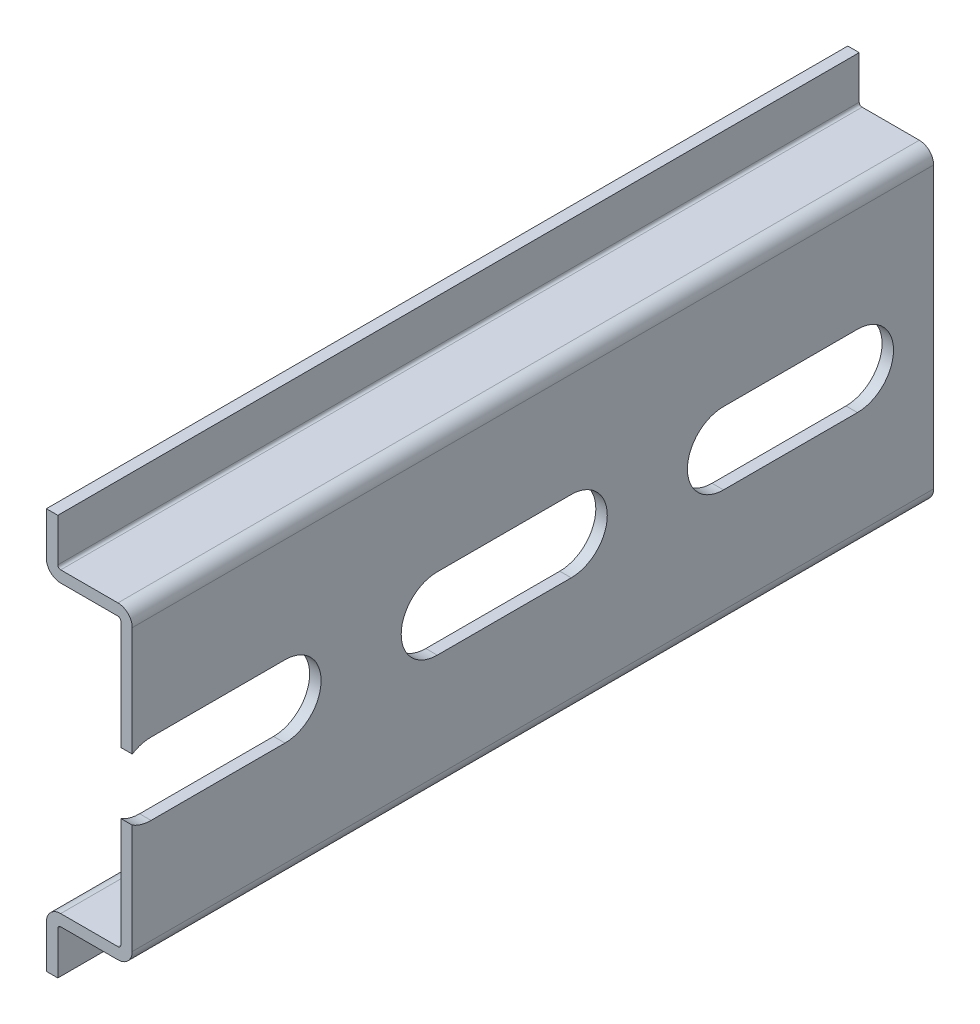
ISO-10303-21;
HEADER;
FILE_DESCRIPTION(('STEP AP214'),'2;1');
FILE_NAME('part.step','',(''),(''),'','','');
FILE_SCHEMA(('AUTOMOTIVE_DESIGN { 1 0 10303 214 1 1 1 1 }'));
ENDSEC;
DATA;
#1=APPLICATION_CONTEXT('core data for automotive mechanical design processes');
#2=APPLICATION_PROTOCOL_DEFINITION('international standard','automotive_design',2000,#1);
#3=PRODUCT_CONTEXT('',#1,'mechanical');
#4=PRODUCT('Part','Part','',(#3));
#5=PRODUCT_RELATED_PRODUCT_CATEGORY('part','',(#4));
#6=PRODUCT_DEFINITION_FORMATION('','',#4);
#7=PRODUCT_DEFINITION_CONTEXT('part definition',#1,'design');
#8=PRODUCT_DEFINITION('design','',#6,#7);
#9=PRODUCT_DEFINITION_SHAPE('','',#8);
#10=(LENGTH_UNIT() NAMED_UNIT(*) SI_UNIT(.MILLI.,.METRE.));
#11=(NAMED_UNIT(*) PLANE_ANGLE_UNIT() SI_UNIT($,.RADIAN.));
#12=(NAMED_UNIT(*) SI_UNIT($,.STERADIAN.) SOLID_ANGLE_UNIT());
#13=UNCERTAINTY_MEASURE_WITH_UNIT(LENGTH_MEASURE(1.E-05),#10,'distance_accuracy_value','');
#14=(GEOMETRIC_REPRESENTATION_CONTEXT(3) GLOBAL_UNCERTAINTY_ASSIGNED_CONTEXT((#13)) GLOBAL_UNIT_ASSIGNED_CONTEXT((#10,
#11,#12)) REPRESENTATION_CONTEXT('',''));
#15=CARTESIAN_POINT('',(0.,0.,0.));
#16=DIRECTION('',(0.,0.,1.));
#17=DIRECTION('',(1.,0.,0.));
#18=AXIS2_PLACEMENT_3D('',#15,#16,#17);
#19=CARTESIAN_POINT('',(-7.5,0.,18.3499999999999));
#20=DIRECTION('',(1.,0.,0.));
#21=DIRECTION('',(0.,0.,-1.));
#22=AXIS2_PLACEMENT_3D('',#19,#20,#21);
#23=CYLINDRICAL_SURFACE('',#22,3.15);
#24=CARTESIAN_POINT('',(0.,0.,18.3499999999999));
#25=DIRECTION('',(1.,0.,0.));
#26=DIRECTION('',(0.,0.,-1.));
#27=AXIS2_PLACEMENT_3D('',#24,#25,#26);
#28=CIRCLE('',#27,3.15);
#29=CARTESIAN_POINT('',(0.,2.68711479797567,19.99375));
#30=VERTEX_POINT('',#29);
#31=CARTESIAN_POINT('',(0.,3.14999999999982,18.3499999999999));
#32=VERTEX_POINT('',#31);
#33=EDGE_CURVE('E341',#30,#32,#28,.F.);
#34=ORIENTED_EDGE('',*,*,#33,.F.);
#35=DIRECTION('',(1.,0.,0.));
#36=VECTOR('',#35,1.);
#37=CARTESIAN_POINT('',(-7.5,2.68711479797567,19.99375));
#38=LINE('',#37,#36);
#39=CARTESIAN_POINT('',(-1.,2.68711479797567,19.99375));
#40=VERTEX_POINT('',#39);
#41=EDGE_CURVE('E452',#30,#40,#38,.F.);
#42=ORIENTED_EDGE('',*,*,#41,.T.);
#43=CARTESIAN_POINT('',(-1.,0.,18.3499999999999));
#44=DIRECTION('',(-1.,0.,0.));
#45=DIRECTION('',(0.,-1.,0.));
#46=AXIS2_PLACEMENT_3D('',#43,#44,#45);
#47=CIRCLE('',#46,3.15);
#48=CARTESIAN_POINT('',(-1.00000000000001,3.14999999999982,18.3499999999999));
#49=VERTEX_POINT('',#48);
#50=EDGE_CURVE('E569',#40,#49,#47,.T.);
#51=ORIENTED_EDGE('',*,*,#50,.T.);
#52=DIRECTION('',(1.,0.,0.));
#53=VECTOR('',#52,1.);
#54=CARTESIAN_POINT('',(-7.5,3.14999999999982,18.3499999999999));
#55=LINE('',#54,#53);
#56=EDGE_CURVE('E502',#49,#32,#55,.T.);
#57=ORIENTED_EDGE('',*,*,#56,.T.);
#58=EDGE_LOOP('',(#34,#42,#51,#57));
#59=FACE_BOUND('',#58,.T.);
#60=ADVANCED_FACE('F41',(#59),#23,.F.);
#61=CARTESIAN_POINT('',(-6.5,13.5,50.00625));
#62=DIRECTION('',(-1.,0.,0.));
#63=DIRECTION('',(0.,-1.,0.));
#64=AXIS2_PLACEMENT_3D('',#61,#62,#63);
#65=PLANE('',#64);
#66=DIRECTION('',(0.,0.,-1.));
#67=VECTOR('',#66,1.);
#68=CARTESIAN_POINT('',(-6.5,17.5,50.00625));
#69=LINE('',#68,#67);
#70=CARTESIAN_POINT('',(-6.5,17.5,19.99375));
#71=VERTEX_POINT('',#70);
#72=CARTESIAN_POINT('',(-6.5,17.5,-50.00625));
#73=VERTEX_POINT('',#72);
#74=EDGE_CURVE('E289',#71,#73,#69,.T.);
#75=ORIENTED_EDGE('',*,*,#74,.F.);
#76=DIRECTION('',(0.,-1.,0.));
#77=VECTOR('',#76,1.);
#78=CARTESIAN_POINT('',(-6.5,13.5,19.99375));
#79=LINE('',#78,#77);
#80=CARTESIAN_POINT('',(-6.5,13.75,19.99375));
#81=VERTEX_POINT('',#80);
#82=EDGE_CURVE('E468',#71,#81,#79,.T.);
#83=ORIENTED_EDGE('',*,*,#82,.T.);
#84=DIRECTION('',(0.,0.,-1.));
#85=VECTOR('',#84,1.);
#86=CARTESIAN_POINT('',(-6.5,13.75,-50.00625));
#87=LINE('',#86,#85);
#88=CARTESIAN_POINT('',(-6.5,13.75,-50.00625));
#89=VERTEX_POINT('',#88);
#90=EDGE_CURVE('E346',#81,#89,#87,.T.);
#91=ORIENTED_EDGE('',*,*,#90,.T.);
#92=DIRECTION('',(0.,1.,0.));
#93=VECTOR('',#92,1.);
#94=CARTESIAN_POINT('',(-6.5,13.5,-50.00625));
#95=LINE('',#94,#93);
#96=EDGE_CURVE('E574',#89,#73,#95,.T.);
#97=ORIENTED_EDGE('',*,*,#96,.T.);
#98=EDGE_LOOP('',(#75,#83,#91,#97));
#99=FACE_BOUND('',#98,.T.);
#100=ADVANCED_FACE('F628',(#99),#65,.F.);
#101=CARTESIAN_POINT('',(-7.5,17.5,50.00625));
#102=DIRECTION('',(0.,1.,0.));
#103=DIRECTION('',(0.,0.,1.));
#104=AXIS2_PLACEMENT_3D('',#101,#102,#103);
#105=PLANE('',#104);
#106=DIRECTION('',(1.,0.,0.));
#107=VECTOR('',#106,1.);
#108=CARTESIAN_POINT('',(-7.5,17.5,19.99375));
#109=LINE('',#108,#107);
#110=CARTESIAN_POINT('',(-7.5,17.5,19.99375));
#111=VERTEX_POINT('',#110);
#112=EDGE_CURVE('E277',#111,#71,#109,.T.);
#113=ORIENTED_EDGE('',*,*,#112,.T.);
#114=ORIENTED_EDGE('',*,*,#74,.T.);
#115=DIRECTION('',(1.,0.,0.));
#116=VECTOR('',#115,1.);
#117=CARTESIAN_POINT('',(-7.5,17.5,-50.00625));
#118=LINE('',#117,#116);
#119=CARTESIAN_POINT('',(-7.5,17.5,-50.00625));
#120=VERTEX_POINT('',#119);
#121=EDGE_CURVE('E578',#120,#73,#118,.T.);
#122=ORIENTED_EDGE('',*,*,#121,.F.);
#123=DIRECTION('',(0.,0.,-1.));
#124=VECTOR('',#123,1.);
#125=CARTESIAN_POINT('',(-7.5,17.5,50.00625));
#126=LINE('',#125,#124);
#127=EDGE_CURVE('E284',#111,#120,#126,.T.);
#128=ORIENTED_EDGE('',*,*,#127,.F.);
#129=EDGE_LOOP('',(#113,#114,#122,#128));
#130=FACE_BOUND('',#129,.T.);
#131=ADVANCED_FACE('F631',(#130),#105,.T.);
#132=CARTESIAN_POINT('',(-7.5,13.5,50.00625));
#133=DIRECTION('',(-1.,0.,0.));
#134=DIRECTION('',(0.,-1.,0.));
#135=AXIS2_PLACEMENT_3D('',#132,#133,#134);
#136=PLANE('',#135);
#137=DIRECTION('',(0.,1.,0.));
#138=VECTOR('',#137,1.);
#139=CARTESIAN_POINT('',(-7.5,17.5,19.99375));
#140=LINE('',#139,#138);
#141=CARTESIAN_POINT('',(-7.5,13.75,19.99375));
#142=VERTEX_POINT('',#141);
#143=EDGE_CURVE('E63',#142,#111,#140,.T.);
#144=ORIENTED_EDGE('',*,*,#143,.T.);
#145=ORIENTED_EDGE('',*,*,#127,.T.);
#146=DIRECTION('',(0.,1.,0.));
#147=VECTOR('',#146,1.);
#148=CARTESIAN_POINT('',(-7.5,13.5,-50.00625));
#149=LINE('',#148,#147);
#150=CARTESIAN_POINT('',(-7.5,13.75,-50.00625));
#151=VERTEX_POINT('',#150);
#152=EDGE_CURVE('E431',#151,#120,#149,.T.);
#153=ORIENTED_EDGE('',*,*,#152,.F.);
#154=DIRECTION('',(0.,0.,-1.));
#155=VECTOR('',#154,1.);
#156=CARTESIAN_POINT('',(-7.5,13.75,50.00625));
#157=LINE('',#156,#155);
#158=EDGE_CURVE('E49',#151,#142,#157,.F.);
#159=ORIENTED_EDGE('',*,*,#158,.T.);
#160=EDGE_LOOP('',(#144,#145,#153,#159));
#161=FACE_BOUND('',#160,.T.);
#162=ADVANCED_FACE('F428',(#161),#136,.T.);
#163=CARTESIAN_POINT('',(0.,12.5,50.00625));
#164=DIRECTION('',(0.,-1.,0.));
#165=DIRECTION('',(1.,0.,0.));
#166=AXIS2_PLACEMENT_3D('',#163,#164,#165);
#167=PLANE('',#166);
#168=DIRECTION('',(1.,0.,0.));
#169=VECTOR('',#168,1.);
#170=CARTESIAN_POINT('',(0.,12.5,19.99375));
#171=LINE('',#170,#169);
#172=CARTESIAN_POINT('',(-6.25,12.5,19.99375));
#173=VERTEX_POINT('',#172);
#174=CARTESIAN_POINT('',(-1.25,12.5,19.99375));
#175=VERTEX_POINT('',#174);
#176=EDGE_CURVE('E438',#173,#175,#171,.T.);
#177=ORIENTED_EDGE('',*,*,#176,.F.);
#178=DIRECTION('',(0.,0.,-1.));
#179=VECTOR('',#178,1.);
#180=CARTESIAN_POINT('',(-6.25,12.5,50.00625));
#181=LINE('',#180,#179);
#182=CARTESIAN_POINT('',(-6.25,12.5,-50.00625));
#183=VERTEX_POINT('',#182);
#184=EDGE_CURVE('E420',#173,#183,#181,.T.);
#185=ORIENTED_EDGE('',*,*,#184,.T.);
#186=DIRECTION('',(-1.,0.,0.));
#187=VECTOR('',#186,1.);
#188=CARTESIAN_POINT('',(0.,12.5,-50.00625));
#189=LINE('',#188,#187);
#190=CARTESIAN_POINT('',(-1.25,12.5,-50.00625));
#191=VERTEX_POINT('',#190);
#192=EDGE_CURVE('E584',#191,#183,#189,.T.);
#193=ORIENTED_EDGE('',*,*,#192,.F.);
#194=DIRECTION('',(0.,0.,-1.));
#195=VECTOR('',#194,1.);
#196=CARTESIAN_POINT('',(-1.25,12.5,50.00625));
#197=LINE('',#196,#195);
#198=EDGE_CURVE('E367',#191,#175,#197,.F.);
#199=ORIENTED_EDGE('',*,*,#198,.T.);
#200=EDGE_LOOP('',(#177,#185,#193,#199));
#201=FACE_BOUND('',#200,.T.);
#202=ADVANCED_FACE('F441',(#201),#167,.T.);
#203=CARTESIAN_POINT('',(-1.,-13.5,50.00625));
#204=DIRECTION('',(-1.,0.,0.));
#205=DIRECTION('',(0.,-1.,0.));
#206=AXIS2_PLACEMENT_3D('',#203,#204,#205);
#207=PLANE('',#206);
#208=DIRECTION('',(0.,-1.,0.));
#209=VECTOR('',#208,1.);
#210=CARTESIAN_POINT('',(-1.,-13.5,19.99375));
#211=LINE('',#210,#209);
#212=CARTESIAN_POINT('',(-1.,12.25,19.99375));
#213=VERTEX_POINT('',#212);
#214=EDGE_CURVE('E446',#213,#40,#211,.T.);
#215=ORIENTED_EDGE('',*,*,#214,.F.);
#216=DIRECTION('',(0.,0.,-1.));
#217=VECTOR('',#216,1.);
#218=CARTESIAN_POINT('',(-1.,12.25,-50.00625));
#219=LINE('',#218,#217);
#220=CARTESIAN_POINT('',(-1.,12.25,-50.00625));
#221=VERTEX_POINT('',#220);
#222=EDGE_CURVE('E364',#213,#221,#219,.T.);
#223=ORIENTED_EDGE('',*,*,#222,.T.);
#224=DIRECTION('',(0.,1.,0.));
#225=VECTOR('',#224,1.);
#226=CARTESIAN_POINT('',(-1.,-13.5,-50.00625));
#227=LINE('',#226,#225);
#228=CARTESIAN_POINT('',(-1.,-12.25,-50.00625));
#229=VERTEX_POINT('',#228);
#230=EDGE_CURVE('E587',#229,#221,#227,.T.);
#231=ORIENTED_EDGE('',*,*,#230,.F.);
#232=DIRECTION('',(0.,0.,-1.));
#233=VECTOR('',#232,1.);
#234=CARTESIAN_POINT('',(-1.,-12.25,50.00625));
#235=LINE('',#234,#233);
#236=CARTESIAN_POINT('',(-1.,-12.25,19.99375));
#237=VERTEX_POINT('',#236);
#238=EDGE_CURVE('E360',#229,#237,#235,.F.);
#239=ORIENTED_EDGE('',*,*,#238,.T.);
#240=CARTESIAN_POINT('',(-1.00000000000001,-2.68711479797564,19.99375));
#241=VERTEX_POINT('',#240);
#242=EDGE_CURVE('E453',#241,#237,#211,.T.);
#243=ORIENTED_EDGE('',*,*,#242,.F.);
#244=CARTESIAN_POINT('',(-1.,-3.15000000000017,18.3499999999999));
#245=VERTEX_POINT('',#244);
#246=EDGE_CURVE('E570',#245,#241,#47,.T.);
#247=ORIENTED_EDGE('',*,*,#246,.F.);
#248=DIRECTION('',(0.,0.,1.));
#249=VECTOR('',#248,1.);
#250=CARTESIAN_POINT('',(-1.,-3.15000000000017,50.00625));
#251=LINE('',#250,#249);
#252=CARTESIAN_POINT('',(-1.,-3.15000000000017,6.65000000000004));
#253=VERTEX_POINT('',#252);
#254=EDGE_CURVE('E559',#253,#245,#251,.T.);
#255=ORIENTED_EDGE('',*,*,#254,.F.);
#256=CARTESIAN_POINT('',(-1.,0.,6.65000000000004));
#257=DIRECTION('',(-1.,0.,0.));
#258=DIRECTION('',(0.,-1.,0.));
#259=AXIS2_PLACEMENT_3D('',#256,#257,#258);
#260=CIRCLE('',#259,3.15);
#261=CARTESIAN_POINT('',(-1.,3.14999999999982,6.65000000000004));
#262=VERTEX_POINT('',#261);
#263=EDGE_CURVE('E562',#262,#253,#260,.T.);
#264=ORIENTED_EDGE('',*,*,#263,.F.);
#265=DIRECTION('',(0.,0.,-1.));
#266=VECTOR('',#265,1.);
#267=CARTESIAN_POINT('',(-1.,3.14999999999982,50.00625));
#268=LINE('',#267,#266);
#269=EDGE_CURVE('E566',#49,#262,#268,.T.);
#270=ORIENTED_EDGE('',*,*,#269,.F.);
#271=ORIENTED_EDGE('',*,*,#50,.F.);
#272=EDGE_LOOP('',(#215,#223,#231,#239,#243,#247,#255,#264,#270,#271));
#273=FACE_BOUND('',#272,.T.);
#274=CARTESIAN_POINT('',(-1.,0.,-31.65));
#275=DIRECTION('',(-1.,0.,0.));
#276=DIRECTION('',(0.,-1.,0.));
#277=AXIS2_PLACEMENT_3D('',#274,#275,#276);
#278=CIRCLE('',#277,3.15);
#279=CARTESIAN_POINT('',(-1.,-3.15,-31.65));
#280=VERTEX_POINT('',#279);
#281=CARTESIAN_POINT('',(-1.00000000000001,3.15,-31.65));
#282=VERTEX_POINT('',#281);
#283=EDGE_CURVE('E556',#280,#282,#278,.T.);
#284=ORIENTED_EDGE('',*,*,#283,.F.);
#285=DIRECTION('',(0.,0.,1.));
#286=VECTOR('',#285,1.);
#287=CARTESIAN_POINT('',(-1.,-3.15,50.00625));
#288=LINE('',#287,#286);
#289=CARTESIAN_POINT('',(-1.,-3.15,-43.35));
#290=VERTEX_POINT('',#289);
#291=EDGE_CURVE('E546',#290,#280,#288,.T.);
#292=ORIENTED_EDGE('',*,*,#291,.F.);
#293=CARTESIAN_POINT('',(-1.,0.,-43.35));
#294=DIRECTION('',(-1.,0.,0.));
#295=DIRECTION('',(0.,-1.,0.));
#296=AXIS2_PLACEMENT_3D('',#293,#294,#295);
#297=CIRCLE('',#296,3.15);
#298=CARTESIAN_POINT('',(-1.,3.15,-43.35));
#299=VERTEX_POINT('',#298);
#300=EDGE_CURVE('E549',#299,#290,#297,.T.);
#301=ORIENTED_EDGE('',*,*,#300,.F.);
#302=DIRECTION('',(0.,0.,-1.));
#303=VECTOR('',#302,1.);
#304=CARTESIAN_POINT('',(-1.,3.15,50.00625));
#305=LINE('',#304,#303);
#306=EDGE_CURVE('E553',#282,#299,#305,.T.);
#307=ORIENTED_EDGE('',*,*,#306,.F.);
#308=EDGE_LOOP('',(#284,#292,#301,#307));
#309=FACE_BOUND('',#308,.T.);
#310=CARTESIAN_POINT('',(-1.,0.,-6.65000000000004));
#311=DIRECTION('',(-1.,0.,0.));
#312=DIRECTION('',(0.,-1.,0.));
#313=AXIS2_PLACEMENT_3D('',#310,#311,#312);
#314=CIRCLE('',#313,3.15);
#315=CARTESIAN_POINT('',(-1.,-3.15,-6.65000000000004));
#316=VERTEX_POINT('',#315);
#317=CARTESIAN_POINT('',(-1.00000000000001,3.15,-6.65000000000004));
#318=VERTEX_POINT('',#317);
#319=EDGE_CURVE('E543',#316,#318,#314,.T.);
#320=ORIENTED_EDGE('',*,*,#319,.F.);
#321=DIRECTION('',(0.,0.,1.));
#322=VECTOR('',#321,1.);
#323=CARTESIAN_POINT('',(-1.,-3.15,50.00625));
#324=LINE('',#323,#322);
#325=CARTESIAN_POINT('',(-1.,-3.15,-18.35));
#326=VERTEX_POINT('',#325);
#327=EDGE_CURVE('E528',#326,#316,#324,.T.);
#328=ORIENTED_EDGE('',*,*,#327,.F.);
#329=CARTESIAN_POINT('',(-1.,0.,-18.35));
#330=DIRECTION('',(-1.,0.,0.));
#331=DIRECTION('',(0.,-1.,0.));
#332=AXIS2_PLACEMENT_3D('',#329,#330,#331);
#333=CIRCLE('',#332,3.15);
#334=CARTESIAN_POINT('',(-1.,3.15,-18.35));
#335=VERTEX_POINT('',#334);
#336=EDGE_CURVE('E536',#335,#326,#333,.T.);
#337=ORIENTED_EDGE('',*,*,#336,.F.);
#338=DIRECTION('',(0.,0.,-1.));
#339=VECTOR('',#338,1.);
#340=CARTESIAN_POINT('',(-1.,3.15,50.00625));
#341=LINE('',#340,#339);
#342=EDGE_CURVE('E540',#318,#335,#341,.T.);
#343=ORIENTED_EDGE('',*,*,#342,.F.);
#344=EDGE_LOOP('',(#320,#328,#337,#343));
#345=FACE_BOUND('',#344,.T.);
#346=ADVANCED_FACE('F639',(#273,#309,#345),#207,.T.);
#347=CARTESIAN_POINT('',(0.,-12.5,50.00625));
#348=DIRECTION('',(0.,1.,0.));
#349=DIRECTION('',(-1.,0.,0.));
#350=AXIS2_PLACEMENT_3D('',#347,#348,#349);
#351=PLANE('',#350);
#352=DIRECTION('',(-1.,0.,0.));
#353=VECTOR('',#352,1.);
#354=CARTESIAN_POINT('',(0.,-12.5,19.99375));
#355=LINE('',#354,#353);
#356=CARTESIAN_POINT('',(-1.25,-12.5,19.99375));
#357=VERTEX_POINT('',#356);
#358=CARTESIAN_POINT('',(-6.25,-12.5,19.99375));
#359=VERTEX_POINT('',#358);
#360=EDGE_CURVE('E485',#357,#359,#355,.T.);
#361=ORIENTED_EDGE('',*,*,#360,.F.);
#362=DIRECTION('',(0.,0.,-1.));
#363=VECTOR('',#362,1.);
#364=CARTESIAN_POINT('',(-1.25,-12.5,-50.00625));
#365=LINE('',#364,#363);
#366=CARTESIAN_POINT('',(-1.25,-12.5,-50.00625));
#367=VERTEX_POINT('',#366);
#368=EDGE_CURVE('E371',#357,#367,#365,.T.);
#369=ORIENTED_EDGE('',*,*,#368,.T.);
#370=DIRECTION('',(1.,0.,0.));
#371=VECTOR('',#370,1.);
#372=CARTESIAN_POINT('',(0.,-12.5,-50.00625));
#373=LINE('',#372,#371);
#374=CARTESIAN_POINT('',(-6.25,-12.5,-50.00625));
#375=VERTEX_POINT('',#374);
#376=EDGE_CURVE('E591',#375,#367,#373,.T.);
#377=ORIENTED_EDGE('',*,*,#376,.F.);
#378=DIRECTION('',(0.,0.,-1.));
#379=VECTOR('',#378,1.);
#380=CARTESIAN_POINT('',(-6.25,-12.5,50.00625));
#381=LINE('',#380,#379);
#382=EDGE_CURVE('E402',#375,#359,#381,.F.);
#383=ORIENTED_EDGE('',*,*,#382,.T.);
#384=EDGE_LOOP('',(#361,#369,#377,#383));
#385=FACE_BOUND('',#384,.T.);
#386=ADVANCED_FACE('F697',(#385),#351,.T.);
#387=CARTESIAN_POINT('',(-7.5,-13.5,50.00625));
#388=DIRECTION('',(-1.,0.,0.));
#389=DIRECTION('',(0.,-1.,0.));
#390=AXIS2_PLACEMENT_3D('',#387,#388,#389);
#391=PLANE('',#390);
#392=CARTESIAN_POINT('',(-7.5,-17.5,19.99375));
#393=VERTEX_POINT('',#392);
#394=CARTESIAN_POINT('',(-7.5,-13.75,19.99375));
#395=VERTEX_POINT('',#394);
#396=EDGE_CURVE('E259',#393,#395,#140,.T.);
#397=ORIENTED_EDGE('',*,*,#396,.T.);
#398=DIRECTION('',(0.,0.,-1.));
#399=VECTOR('',#398,1.);
#400=CARTESIAN_POINT('',(-7.5,-13.75,50.00625));
#401=LINE('',#400,#399);
#402=CARTESIAN_POINT('',(-7.5,-13.75,-50.00625));
#403=VERTEX_POINT('',#402);
#404=EDGE_CURVE('E387',#395,#403,#401,.T.);
#405=ORIENTED_EDGE('',*,*,#404,.T.);
#406=DIRECTION('',(0.,1.,0.));
#407=VECTOR('',#406,1.);
#408=CARTESIAN_POINT('',(-7.5,-13.5,-50.00625));
#409=LINE('',#408,#407);
#410=CARTESIAN_POINT('',(-7.5,-17.5,-50.00625));
#411=VERTEX_POINT('',#410);
#412=EDGE_CURVE('E282',#411,#403,#409,.T.);
#413=ORIENTED_EDGE('',*,*,#412,.F.);
#414=DIRECTION('',(0.,0.,-1.));
#415=VECTOR('',#414,1.);
#416=CARTESIAN_POINT('',(-7.5,-17.5,50.00625));
#417=LINE('',#416,#415);
#418=EDGE_CURVE('E274',#393,#411,#417,.T.);
#419=ORIENTED_EDGE('',*,*,#418,.F.);
#420=EDGE_LOOP('',(#397,#405,#413,#419));
#421=FACE_BOUND('',#420,.T.);
#422=ADVANCED_FACE('F280',(#421),#391,.T.);
#423=CARTESIAN_POINT('',(-6.5,-17.5,50.00625));
#424=DIRECTION('',(0.,-1.,0.));
#425=DIRECTION('',(0.,0.,-1.));
#426=AXIS2_PLACEMENT_3D('',#423,#424,#425);
#427=PLANE('',#426);
#428=DIRECTION('',(1.,0.,0.));
#429=VECTOR('',#428,1.);
#430=CARTESIAN_POINT('',(-7.5,-17.5,19.99375));
#431=LINE('',#430,#429);
#432=CARTESIAN_POINT('',(-6.5,-17.5,19.99375));
#433=VERTEX_POINT('',#432);
#434=EDGE_CURVE('E262',#393,#433,#431,.T.);
#435=ORIENTED_EDGE('',*,*,#434,.F.);
#436=ORIENTED_EDGE('',*,*,#418,.T.);
#437=DIRECTION('',(-1.,0.,0.));
#438=VECTOR('',#437,1.);
#439=CARTESIAN_POINT('',(-6.5,-17.5,-50.00625));
#440=LINE('',#439,#438);
#441=CARTESIAN_POINT('',(-6.5,-17.5,-50.00625));
#442=VERTEX_POINT('',#441);
#443=EDGE_CURVE('E597',#442,#411,#440,.T.);
#444=ORIENTED_EDGE('',*,*,#443,.F.);
#445=DIRECTION('',(0.,0.,-1.));
#446=VECTOR('',#445,1.);
#447=CARTESIAN_POINT('',(-6.5,-17.5,50.00625));
#448=LINE('',#447,#446);
#449=EDGE_CURVE('E276',#433,#442,#448,.T.);
#450=ORIENTED_EDGE('',*,*,#449,.F.);
#451=EDGE_LOOP('',(#435,#436,#444,#450));
#452=FACE_BOUND('',#451,.T.);
#453=ADVANCED_FACE('F272',(#452),#427,.T.);
#454=CARTESIAN_POINT('',(-6.5,-13.5,50.00625));
#455=DIRECTION('',(-1.,0.,0.));
#456=DIRECTION('',(0.,-1.,0.));
#457=AXIS2_PLACEMENT_3D('',#454,#455,#456);
#458=PLANE('',#457);
#459=DIRECTION('',(0.,0.,-1.));
#460=VECTOR('',#459,1.);
#461=CARTESIAN_POINT('',(-6.5,-13.75,50.00625));
#462=LINE('',#461,#460);
#463=CARTESIAN_POINT('',(-6.5,-13.75,-50.00625));
#464=VERTEX_POINT('',#463);
#465=CARTESIAN_POINT('',(-6.5,-13.75,19.99375));
#466=VERTEX_POINT('',#465);
#467=EDGE_CURVE('E356',#464,#466,#462,.F.);
#468=ORIENTED_EDGE('',*,*,#467,.T.);
#469=DIRECTION('',(0.,-1.,0.));
#470=VECTOR('',#469,1.);
#471=CARTESIAN_POINT('',(-6.5,-13.5,19.99375));
#472=LINE('',#471,#470);
#473=EDGE_CURVE('E480',#466,#433,#472,.T.);
#474=ORIENTED_EDGE('',*,*,#473,.T.);
#475=ORIENTED_EDGE('',*,*,#449,.T.);
#476=DIRECTION('',(0.,1.,0.));
#477=VECTOR('',#476,1.);
#478=CARTESIAN_POINT('',(-6.5,-13.5,-50.00625));
#479=LINE('',#478,#477);
#480=EDGE_CURVE('E600',#442,#464,#479,.T.);
#481=ORIENTED_EDGE('',*,*,#480,.T.);
#482=EDGE_LOOP('',(#468,#474,#475,#481));
#483=FACE_BOUND('',#482,.T.);
#484=ADVANCED_FACE('F919',(#483),#458,.F.);
#485=CARTESIAN_POINT('',(0.,-13.5,50.00625));
#486=DIRECTION('',(0.,1.,0.));
#487=DIRECTION('',(-1.,0.,0.));
#488=AXIS2_PLACEMENT_3D('',#485,#486,#487);
#489=PLANE('',#488);
#490=DIRECTION('',(0.,0.,-1.));
#491=VECTOR('',#490,1.);
#492=CARTESIAN_POINT('',(-1.25,-13.5,50.00625));
#493=LINE('',#492,#491);
#494=CARTESIAN_POINT('',(-1.25,-13.5,-50.00625));
#495=VERTEX_POINT('',#494);
#496=CARTESIAN_POINT('',(-1.25,-13.5,19.99375));
#497=VERTEX_POINT('',#496);
#498=EDGE_CURVE('E413',#495,#497,#493,.F.);
#499=ORIENTED_EDGE('',*,*,#498,.T.);
#500=DIRECTION('',(-1.,0.,0.));
#501=VECTOR('',#500,1.);
#502=CARTESIAN_POINT('',(0.,-13.5,19.99375));
#503=LINE('',#502,#501);
#504=CARTESIAN_POINT('',(-6.25,-13.5,19.99375));
#505=VERTEX_POINT('',#504);
#506=EDGE_CURVE('E56',#497,#505,#503,.T.);
#507=ORIENTED_EDGE('',*,*,#506,.T.);
#508=DIRECTION('',(0.,0.,-1.));
#509=VECTOR('',#508,1.);
#510=CARTESIAN_POINT('',(-6.25,-13.5,-50.00625));
#511=LINE('',#510,#509);
#512=CARTESIAN_POINT('',(-6.25,-13.5,-50.00625));
#513=VERTEX_POINT('',#512);
#514=EDGE_CURVE('E353',#505,#513,#511,.T.);
#515=ORIENTED_EDGE('',*,*,#514,.T.);
#516=DIRECTION('',(1.,0.,0.));
#517=VECTOR('',#516,1.);
#518=CARTESIAN_POINT('',(0.,-13.5,-50.00625));
#519=LINE('',#518,#517);
#520=EDGE_CURVE('E604',#513,#495,#519,.T.);
#521=ORIENTED_EDGE('',*,*,#520,.T.);
#522=EDGE_LOOP('',(#499,#507,#515,#521));
#523=FACE_BOUND('',#522,.T.);
#524=ADVANCED_FACE('F728',(#523),#489,.F.);
#525=CARTESIAN_POINT('',(0.,-13.5,50.00625));
#526=DIRECTION('',(-1.,0.,0.));
#527=DIRECTION('',(0.,-1.,0.));
#528=AXIS2_PLACEMENT_3D('',#525,#526,#527);
#529=PLANE('',#528);
#530=DIRECTION('',(0.,0.,-1.));
#531=VECTOR('',#530,1.);
#532=CARTESIAN_POINT('',(0.,12.25,50.00625));
#533=LINE('',#532,#531);
#534=CARTESIAN_POINT('',(0.,12.25,-50.00625));
#535=VERTEX_POINT('',#534);
#536=CARTESIAN_POINT('',(0.,12.25,19.99375));
#537=VERTEX_POINT('',#536);
#538=EDGE_CURVE('E406',#535,#537,#533,.F.);
#539=ORIENTED_EDGE('',*,*,#538,.T.);
#540=DIRECTION('',(0.,-1.,0.));
#541=VECTOR('',#540,1.);
#542=CARTESIAN_POINT('',(0.,-13.5,19.99375));
#543=LINE('',#542,#541);
#544=EDGE_CURVE('E456',#537,#30,#543,.T.);
#545=ORIENTED_EDGE('',*,*,#544,.T.);
#546=ORIENTED_EDGE('',*,*,#33,.T.);
#547=DIRECTION('',(0.,0.,1.));
#548=VECTOR('',#547,1.);
#549=CARTESIAN_POINT('',(0.,3.14999999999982,50.00625));
#550=LINE('',#549,#548);
#551=CARTESIAN_POINT('',(0.,3.14999999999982,6.65000000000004));
#552=VERTEX_POINT('',#551);
#553=EDGE_CURVE('E337',#32,#552,#550,.F.);
#554=ORIENTED_EDGE('',*,*,#553,.T.);
#555=CARTESIAN_POINT('',(0.,0.,6.65000000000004));
#556=DIRECTION('',(1.,0.,0.));
#557=DIRECTION('',(0.,0.,-1.));
#558=AXIS2_PLACEMENT_3D('',#555,#556,#557);
#559=CIRCLE('',#558,3.15);
#560=CARTESIAN_POINT('',(0.,-3.15000000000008,6.65000000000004));
#561=VERTEX_POINT('',#560);
#562=EDGE_CURVE('E333',#552,#561,#559,.F.);
#563=ORIENTED_EDGE('',*,*,#562,.T.);
#564=DIRECTION('',(0.,0.,1.));
#565=VECTOR('',#564,1.);
#566=CARTESIAN_POINT('',(0.,-3.15000000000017,50.00625));
#567=LINE('',#566,#565);
#568=CARTESIAN_POINT('',(0.,-3.15000000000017,18.3499999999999));
#569=VERTEX_POINT('',#568);
#570=EDGE_CURVE('E329',#561,#569,#567,.T.);
#571=ORIENTED_EDGE('',*,*,#570,.T.);
#572=CARTESIAN_POINT('',(0.,-2.68711479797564,19.99375));
#573=VERTEX_POINT('',#572);
#574=EDGE_CURVE('E342',#569,#573,#28,.F.);
#575=ORIENTED_EDGE('',*,*,#574,.T.);
#576=CARTESIAN_POINT('',(0.,-12.25,19.99375));
#577=VERTEX_POINT('',#576);
#578=EDGE_CURVE('E460',#573,#577,#543,.T.);
#579=ORIENTED_EDGE('',*,*,#578,.T.);
#580=DIRECTION('',(0.,0.,-1.));
#581=VECTOR('',#580,1.);
#582=CARTESIAN_POINT('',(0.,-12.25,50.00625));
#583=LINE('',#582,#581);
#584=CARTESIAN_POINT('',(0.,-12.25,-50.00625));
#585=VERTEX_POINT('',#584);
#586=EDGE_CURVE('E410',#577,#585,#583,.T.);
#587=ORIENTED_EDGE('',*,*,#586,.T.);
#588=DIRECTION('',(0.,1.,0.));
#589=VECTOR('',#588,1.);
#590=CARTESIAN_POINT('',(0.,-13.5,-50.00625));
#591=LINE('',#590,#589);
#592=EDGE_CURVE('E608',#585,#535,#591,.T.);
#593=ORIENTED_EDGE('',*,*,#592,.T.);
#594=EDGE_LOOP('',(#539,#545,#546,#554,#563,#571,#575,#579,#587,#593));
#595=FACE_BOUND('',#594,.T.);
#596=DIRECTION('',(0.,0.,1.));
#597=VECTOR('',#596,1.);
#598=CARTESIAN_POINT('',(0.,-3.15,50.00625));
#599=LINE('',#598,#597);
#600=CARTESIAN_POINT('',(0.,-3.14999999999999,-43.35));
#601=VERTEX_POINT('',#600);
#602=CARTESIAN_POINT('',(0.,-3.15,-31.65));
#603=VERTEX_POINT('',#602);
#604=EDGE_CURVE('E313',#601,#603,#599,.T.);
#605=ORIENTED_EDGE('',*,*,#604,.T.);
#606=CARTESIAN_POINT('',(0.,0.,-31.65));
#607=DIRECTION('',(1.,0.,0.));
#608=DIRECTION('',(0.,0.,-1.));
#609=AXIS2_PLACEMENT_3D('',#606,#607,#608);
#610=CIRCLE('',#609,3.15);
#611=CARTESIAN_POINT('',(0.,3.15,-31.6500000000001));
#612=VERTEX_POINT('',#611);
#613=EDGE_CURVE('E325',#603,#612,#610,.F.);
#614=ORIENTED_EDGE('',*,*,#613,.T.);
#615=DIRECTION('',(0.,0.,1.));
#616=VECTOR('',#615,1.);
#617=CARTESIAN_POINT('',(0.,3.15,50.00625));
#618=LINE('',#617,#616);
#619=CARTESIAN_POINT('',(0.,3.15,-43.35));
#620=VERTEX_POINT('',#619);
#621=EDGE_CURVE('E321',#612,#620,#618,.F.);
#622=ORIENTED_EDGE('',*,*,#621,.T.);
#623=CARTESIAN_POINT('',(0.,0.,-43.35));
#624=DIRECTION('',(1.,0.,0.));
#625=DIRECTION('',(0.,0.,-1.));
#626=AXIS2_PLACEMENT_3D('',#623,#624,#625);
#627=CIRCLE('',#626,3.15);
#628=EDGE_CURVE('E317',#620,#601,#627,.F.);
#629=ORIENTED_EDGE('',*,*,#628,.T.);
#630=EDGE_LOOP('',(#605,#614,#622,#629));
#631=FACE_BOUND('',#630,.T.);
#632=DIRECTION('',(0.,0.,1.));
#633=VECTOR('',#632,1.);
#634=CARTESIAN_POINT('',(0.,-3.15,50.00625));
#635=LINE('',#634,#633);
#636=CARTESIAN_POINT('',(0.,-3.14999999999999,-18.35));
#637=VERTEX_POINT('',#636);
#638=CARTESIAN_POINT('',(0.,-3.14999999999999,-6.65000000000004));
#639=VERTEX_POINT('',#638);
#640=EDGE_CURVE('E297',#637,#639,#635,.T.);
#641=ORIENTED_EDGE('',*,*,#640,.T.);
#642=CARTESIAN_POINT('',(0.,0.,-6.65000000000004));
#643=DIRECTION('',(1.,0.,0.));
#644=DIRECTION('',(0.,0.,-1.));
#645=AXIS2_PLACEMENT_3D('',#642,#643,#644);
#646=CIRCLE('',#645,3.15);
#647=CARTESIAN_POINT('',(0.,3.15,-6.65000000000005));
#648=VERTEX_POINT('',#647);
#649=EDGE_CURVE('E309',#639,#648,#646,.F.);
#650=ORIENTED_EDGE('',*,*,#649,.T.);
#651=DIRECTION('',(0.,0.,1.));
#652=VECTOR('',#651,1.);
#653=CARTESIAN_POINT('',(0.,3.15,50.00625));
#654=LINE('',#653,#652);
#655=CARTESIAN_POINT('',(0.,3.15,-18.35));
#656=VERTEX_POINT('',#655);
#657=EDGE_CURVE('E305',#648,#656,#654,.F.);
#658=ORIENTED_EDGE('',*,*,#657,.T.);
#659=CARTESIAN_POINT('',(0.,0.,-18.35));
#660=DIRECTION('',(1.,0.,0.));
#661=DIRECTION('',(0.,0.,-1.));
#662=AXIS2_PLACEMENT_3D('',#659,#660,#661);
#663=CIRCLE('',#662,3.15);
#664=EDGE_CURVE('E301',#656,#637,#663,.F.);
#665=ORIENTED_EDGE('',*,*,#664,.T.);
#666=EDGE_LOOP('',(#641,#650,#658,#665));
#667=FACE_BOUND('',#666,.T.);
#668=ADVANCED_FACE('F655',(#595,#631,#667),#529,.F.);
#669=CARTESIAN_POINT('',(0.,13.5,50.00625));
#670=DIRECTION('',(0.,-1.,0.));
#671=DIRECTION('',(1.,0.,0.));
#672=AXIS2_PLACEMENT_3D('',#669,#670,#671);
#673=PLANE('',#672);
#674=DIRECTION('',(0.,0.,-1.));
#675=VECTOR('',#674,1.);
#676=CARTESIAN_POINT('',(-6.25,13.5,50.00625));
#677=LINE('',#676,#675);
#678=CARTESIAN_POINT('',(-6.25,13.5,-50.00625));
#679=VERTEX_POINT('',#678);
#680=CARTESIAN_POINT('',(-6.25,13.5,19.99375));
#681=VERTEX_POINT('',#680);
#682=EDGE_CURVE('E349',#679,#681,#677,.F.);
#683=ORIENTED_EDGE('',*,*,#682,.T.);
#684=DIRECTION('',(1.,0.,0.));
#685=VECTOR('',#684,1.);
#686=CARTESIAN_POINT('',(0.,13.5,19.99375));
#687=LINE('',#686,#685);
#688=CARTESIAN_POINT('',(-1.25,13.5,19.99375));
#689=VERTEX_POINT('',#688);
#690=EDGE_CURVE('E462',#681,#689,#687,.T.);
#691=ORIENTED_EDGE('',*,*,#690,.T.);
#692=DIRECTION('',(0.,0.,-1.));
#693=VECTOR('',#692,1.);
#694=CARTESIAN_POINT('',(-1.25000000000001,13.5,50.00625));
#695=LINE('',#694,#693);
#696=CARTESIAN_POINT('',(-1.25000000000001,13.5,-50.00625));
#697=VERTEX_POINT('',#696);
#698=EDGE_CURVE('E417',#689,#697,#695,.T.);
#699=ORIENTED_EDGE('',*,*,#698,.T.);
#700=DIRECTION('',(-1.,0.,0.));
#701=VECTOR('',#700,1.);
#702=CARTESIAN_POINT('',(0.,13.5,-50.00625));
#703=LINE('',#702,#701);
#704=EDGE_CURVE('E291',#697,#679,#703,.T.);
#705=ORIENTED_EDGE('',*,*,#704,.T.);
#706=EDGE_LOOP('',(#683,#691,#699,#705));
#707=FACE_BOUND('',#706,.T.);
#708=ADVANCED_FACE('F615',(#707),#673,.F.);
#709=CARTESIAN_POINT('',(0.,0.,-50.00625));
#710=DIRECTION('',(0.,0.,-1.));
#711=DIRECTION('',(-1.,0.,0.));
#712=AXIS2_PLACEMENT_3D('',#709,#710,#711);
#713=PLANE('',#712);
#714=ORIENTED_EDGE('',*,*,#412,.T.);
#715=CARTESIAN_POINT('',(-6.25,-13.75,-50.00625));
#716=DIRECTION('',(0.,0.,-1.));
#717=DIRECTION('',(-1.,0.,0.));
#718=AXIS2_PLACEMENT_3D('',#715,#716,#717);
#719=CIRCLE('',#718,1.25);
#720=EDGE_CURVE('E399',#403,#375,#719,.T.);
#721=ORIENTED_EDGE('',*,*,#720,.T.);
#722=ORIENTED_EDGE('',*,*,#376,.T.);
#723=CARTESIAN_POINT('',(-1.25,-12.25,-50.00625));
#724=DIRECTION('',(0.,0.,-1.));
#725=DIRECTION('',(-1.,0.,0.));
#726=AXIS2_PLACEMENT_3D('',#723,#724,#725);
#727=CIRCLE('',#726,0.25);
#728=EDGE_CURVE('E384',#367,#229,#727,.F.);
#729=ORIENTED_EDGE('',*,*,#728,.T.);
#730=ORIENTED_EDGE('',*,*,#230,.T.);
#731=CARTESIAN_POINT('',(-1.25,12.25,-50.00625));
#732=DIRECTION('',(0.,0.,-1.));
#733=DIRECTION('',(-1.,0.,0.));
#734=AXIS2_PLACEMENT_3D('',#731,#732,#733);
#735=CIRCLE('',#734,0.25);
#736=EDGE_CURVE('E381',#221,#191,#735,.F.);
#737=ORIENTED_EDGE('',*,*,#736,.T.);
#738=ORIENTED_EDGE('',*,*,#192,.T.);
#739=CARTESIAN_POINT('',(-6.25,13.75,-50.00625));
#740=DIRECTION('',(0.,0.,-1.));
#741=DIRECTION('',(-1.,0.,0.));
#742=AXIS2_PLACEMENT_3D('',#739,#740,#741);
#743=CIRCLE('',#742,1.25);
#744=EDGE_CURVE('E390',#183,#151,#743,.T.);
#745=ORIENTED_EDGE('',*,*,#744,.T.);
#746=ORIENTED_EDGE('',*,*,#152,.T.);
#747=ORIENTED_EDGE('',*,*,#121,.T.);
#748=ORIENTED_EDGE('',*,*,#96,.F.);
#749=CARTESIAN_POINT('',(-6.25,13.75,-50.00625));
#750=DIRECTION('',(0.,0.,-1.));
#751=DIRECTION('',(-1.,0.,0.));
#752=AXIS2_PLACEMENT_3D('',#749,#750,#751);
#753=CIRCLE('',#752,0.25);
#754=EDGE_CURVE('E374',#89,#679,#753,.F.);
#755=ORIENTED_EDGE('',*,*,#754,.T.);
#756=ORIENTED_EDGE('',*,*,#704,.F.);
#757=CARTESIAN_POINT('',(-1.25,12.25,-50.00625));
#758=DIRECTION('',(0.,0.,-1.));
#759=DIRECTION('',(-1.,0.,0.));
#760=AXIS2_PLACEMENT_3D('',#757,#758,#759);
#761=CIRCLE('',#760,1.25);
#762=EDGE_CURVE('E393',#697,#535,#761,.T.);
#763=ORIENTED_EDGE('',*,*,#762,.T.);
#764=ORIENTED_EDGE('',*,*,#592,.F.);
#765=CARTESIAN_POINT('',(-1.25,-12.25,-50.00625));
#766=DIRECTION('',(0.,0.,-1.));
#767=DIRECTION('',(-1.,0.,0.));
#768=AXIS2_PLACEMENT_3D('',#765,#766,#767);
#769=CIRCLE('',#768,1.25);
#770=EDGE_CURVE('E396',#585,#495,#769,.T.);
#771=ORIENTED_EDGE('',*,*,#770,.T.);
#772=ORIENTED_EDGE('',*,*,#520,.F.);
#773=CARTESIAN_POINT('',(-6.25,-13.75,-50.00625));
#774=DIRECTION('',(0.,0.,-1.));
#775=DIRECTION('',(-1.,0.,0.));
#776=AXIS2_PLACEMENT_3D('',#773,#774,#775);
#777=CIRCLE('',#776,0.25);
#778=EDGE_CURVE('E378',#513,#464,#777,.F.);
#779=ORIENTED_EDGE('',*,*,#778,.T.);
#780=ORIENTED_EDGE('',*,*,#480,.F.);
#781=ORIENTED_EDGE('',*,*,#443,.T.);
#782=EDGE_LOOP('',(#714,#721,#722,#729,#730,#737,#738,#745,#746,#747,#748,#755,#756,#763,#764,
#771,#772,#779,#780,#781));
#783=FACE_BOUND('',#782,.T.);
#784=ADVANCED_FACE('F622',(#783),#713,.T.);
#785=CARTESIAN_POINT('',(-7.5,0.,-6.65000000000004));
#786=DIRECTION('',(1.,0.,0.));
#787=DIRECTION('',(0.,0.,-1.));
#788=AXIS2_PLACEMENT_3D('',#785,#786,#787);
#789=CYLINDRICAL_SURFACE('',#788,3.15);
#790=ORIENTED_EDGE('',*,*,#319,.T.);
#791=DIRECTION('',(1.,0.,0.));
#792=VECTOR('',#791,1.);
#793=CARTESIAN_POINT('',(-7.5,3.15,-6.65000000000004));
#794=LINE('',#793,#792);
#795=EDGE_CURVE('E523',#318,#648,#794,.T.);
#796=ORIENTED_EDGE('',*,*,#795,.T.);
#797=ORIENTED_EDGE('',*,*,#649,.F.);
#798=DIRECTION('',(1.,0.,0.));
#799=VECTOR('',#798,1.);
#800=CARTESIAN_POINT('',(-7.5,-3.15,-6.65000000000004));
#801=LINE('',#800,#799);
#802=EDGE_CURVE('E498',#316,#639,#801,.T.);
#803=ORIENTED_EDGE('',*,*,#802,.F.);
#804=EDGE_LOOP('',(#790,#796,#797,#803));
#805=FACE_BOUND('',#804,.T.);
#806=ADVANCED_FACE('F832',(#805),#789,.F.);
#807=CARTESIAN_POINT('',(-7.5,3.15,-6.65000000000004));
#808=DIRECTION('',(0.,1.,0.));
#809=DIRECTION('',(0.,0.,1.));
#810=AXIS2_PLACEMENT_3D('',#807,#808,#809);
#811=PLANE('',#810);
#812=ORIENTED_EDGE('',*,*,#342,.T.);
#813=DIRECTION('',(1.,0.,0.));
#814=VECTOR('',#813,1.);
#815=CARTESIAN_POINT('',(-7.5,3.15,-18.35));
#816=LINE('',#815,#814);
#817=EDGE_CURVE('E519',#335,#656,#816,.T.);
#818=ORIENTED_EDGE('',*,*,#817,.T.);
#819=ORIENTED_EDGE('',*,*,#657,.F.);
#820=ORIENTED_EDGE('',*,*,#795,.F.);
#821=EDGE_LOOP('',(#812,#818,#819,#820));
#822=FACE_BOUND('',#821,.T.);
#823=ADVANCED_FACE('F846',(#822),#811,.F.);
#824=CARTESIAN_POINT('',(-7.5,0.,-18.35));
#825=DIRECTION('',(1.,0.,0.));
#826=DIRECTION('',(0.,0.,-1.));
#827=AXIS2_PLACEMENT_3D('',#824,#825,#826);
#828=CYLINDRICAL_SURFACE('',#827,3.15);
#829=ORIENTED_EDGE('',*,*,#336,.T.);
#830=DIRECTION('',(1.,0.,0.));
#831=VECTOR('',#830,1.);
#832=CARTESIAN_POINT('',(-7.5,-3.14999999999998,-18.35));
#833=LINE('',#832,#831);
#834=EDGE_CURVE('E524',#326,#637,#833,.T.);
#835=ORIENTED_EDGE('',*,*,#834,.T.);
#836=ORIENTED_EDGE('',*,*,#664,.F.);
#837=ORIENTED_EDGE('',*,*,#817,.F.);
#838=EDGE_LOOP('',(#829,#835,#836,#837));
#839=FACE_BOUND('',#838,.T.);
#840=ADVANCED_FACE('F853',(#839),#828,.F.);
#841=CARTESIAN_POINT('',(-7.5,-3.15,-6.65000000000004));
#842=DIRECTION('',(0.,-1.,0.));
#843=DIRECTION('',(0.,0.,-1.));
#844=AXIS2_PLACEMENT_3D('',#841,#842,#843);
#845=PLANE('',#844);
#846=ORIENTED_EDGE('',*,*,#327,.T.);
#847=ORIENTED_EDGE('',*,*,#802,.T.);
#848=ORIENTED_EDGE('',*,*,#640,.F.);
#849=ORIENTED_EDGE('',*,*,#834,.F.);
#850=EDGE_LOOP('',(#846,#847,#848,#849));
#851=FACE_BOUND('',#850,.T.);
#852=ADVANCED_FACE('F743',(#851),#845,.F.);
#853=CARTESIAN_POINT('',(-7.5,0.,-31.65));
#854=DIRECTION('',(1.,0.,0.));
#855=DIRECTION('',(0.,0.,-1.));
#856=AXIS2_PLACEMENT_3D('',#853,#854,#855);
#857=CYLINDRICAL_SURFACE('',#856,3.15);
#858=ORIENTED_EDGE('',*,*,#283,.T.);
#859=DIRECTION('',(1.,0.,0.));
#860=VECTOR('',#859,1.);
#861=CARTESIAN_POINT('',(-7.5,3.15,-31.65));
#862=LINE('',#861,#860);
#863=EDGE_CURVE('E493',#282,#612,#862,.T.);
#864=ORIENTED_EDGE('',*,*,#863,.T.);
#865=ORIENTED_EDGE('',*,*,#613,.F.);
#866=DIRECTION('',(1.,0.,0.));
#867=VECTOR('',#866,1.);
#868=CARTESIAN_POINT('',(-7.5,-3.15,-31.65));
#869=LINE('',#868,#867);
#870=EDGE_CURVE('E499',#280,#603,#869,.T.);
#871=ORIENTED_EDGE('',*,*,#870,.F.);
#872=EDGE_LOOP('',(#858,#864,#865,#871));
#873=FACE_BOUND('',#872,.T.);
#874=ADVANCED_FACE('F740',(#873),#857,.F.);
#875=CARTESIAN_POINT('',(-7.5,3.15,-31.65));
#876=DIRECTION('',(0.,1.,0.));
#877=DIRECTION('',(0.,0.,1.));
#878=AXIS2_PLACEMENT_3D('',#875,#876,#877);
#879=PLANE('',#878);
#880=ORIENTED_EDGE('',*,*,#306,.T.);
#881=DIRECTION('',(1.,0.,0.));
#882=VECTOR('',#881,1.);
#883=CARTESIAN_POINT('',(-7.5,3.15,-43.35));
#884=LINE('',#883,#882);
#885=EDGE_CURVE('E489',#299,#620,#884,.T.);
#886=ORIENTED_EDGE('',*,*,#885,.T.);
#887=ORIENTED_EDGE('',*,*,#621,.F.);
#888=ORIENTED_EDGE('',*,*,#863,.F.);
#889=EDGE_LOOP('',(#880,#886,#887,#888));
#890=FACE_BOUND('',#889,.T.);
#891=ADVANCED_FACE('F742',(#890),#879,.F.);
#892=CARTESIAN_POINT('',(-7.5,0.,-43.35));
#893=DIRECTION('',(1.,0.,0.));
#894=DIRECTION('',(0.,0.,-1.));
#895=AXIS2_PLACEMENT_3D('',#892,#893,#894);
#896=CYLINDRICAL_SURFACE('',#895,3.15);
#897=ORIENTED_EDGE('',*,*,#300,.T.);
#898=DIRECTION('',(1.,0.,0.));
#899=VECTOR('',#898,1.);
#900=CARTESIAN_POINT('',(-7.5,-3.14999999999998,-43.35));
#901=LINE('',#900,#899);
#902=EDGE_CURVE('E494',#290,#601,#901,.T.);
#903=ORIENTED_EDGE('',*,*,#902,.T.);
#904=ORIENTED_EDGE('',*,*,#628,.F.);
#905=ORIENTED_EDGE('',*,*,#885,.F.);
#906=EDGE_LOOP('',(#897,#903,#904,#905));
#907=FACE_BOUND('',#906,.T.);
#908=ADVANCED_FACE('F681',(#907),#896,.F.);
#909=CARTESIAN_POINT('',(-7.5,-3.15,-31.65));
#910=DIRECTION('',(0.,-1.,0.));
#911=DIRECTION('',(0.,0.,-1.));
#912=AXIS2_PLACEMENT_3D('',#909,#910,#911);
#913=PLANE('',#912);
#914=ORIENTED_EDGE('',*,*,#291,.T.);
#915=ORIENTED_EDGE('',*,*,#870,.T.);
#916=ORIENTED_EDGE('',*,*,#604,.F.);
#917=ORIENTED_EDGE('',*,*,#902,.F.);
#918=EDGE_LOOP('',(#914,#915,#916,#917));
#919=FACE_BOUND('',#918,.T.);
#920=ADVANCED_FACE('F671',(#919),#913,.F.);
#921=ORIENTED_EDGE('',*,*,#246,.T.);
#922=DIRECTION('',(1.,0.,0.));
#923=VECTOR('',#922,1.);
#924=CARTESIAN_POINT('',(-7.5,-2.68711479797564,19.99375));
#925=LINE('',#924,#923);
#926=EDGE_CURVE('E477',#241,#573,#925,.T.);
#927=ORIENTED_EDGE('',*,*,#926,.T.);
#928=ORIENTED_EDGE('',*,*,#574,.F.);
#929=DIRECTION('',(1.,0.,0.));
#930=VECTOR('',#929,1.);
#931=CARTESIAN_POINT('',(-7.5,-3.15000000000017,18.3499999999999));
#932=LINE('',#931,#930);
#933=EDGE_CURVE('E488',#245,#569,#932,.T.);
#934=ORIENTED_EDGE('',*,*,#933,.F.);
#935=EDGE_LOOP('',(#921,#927,#928,#934));
#936=FACE_BOUND('',#935,.T.);
#937=ADVANCED_FACE('F662',(#936),#23,.F.);
#938=CARTESIAN_POINT('',(-7.5,3.14999999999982,18.3499999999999));
#939=DIRECTION('',(0.,1.,0.));
#940=DIRECTION('',(0.,0.,1.));
#941=AXIS2_PLACEMENT_3D('',#938,#939,#940);
#942=PLANE('',#941);
#943=ORIENTED_EDGE('',*,*,#269,.T.);
#944=DIRECTION('',(1.,0.,0.));
#945=VECTOR('',#944,1.);
#946=CARTESIAN_POINT('',(-7.5,3.14999999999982,6.65000000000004));
#947=LINE('',#946,#945);
#948=EDGE_CURVE('E506',#262,#552,#947,.T.);
#949=ORIENTED_EDGE('',*,*,#948,.T.);
#950=ORIENTED_EDGE('',*,*,#553,.F.);
#951=ORIENTED_EDGE('',*,*,#56,.F.);
#952=EDGE_LOOP('',(#943,#949,#950,#951));
#953=FACE_BOUND('',#952,.T.);
#954=ADVANCED_FACE('F658',(#953),#942,.F.);
#955=CARTESIAN_POINT('',(-7.5,0.,6.65000000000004));
#956=DIRECTION('',(1.,0.,0.));
#957=DIRECTION('',(0.,0.,-1.));
#958=AXIS2_PLACEMENT_3D('',#955,#956,#957);
#959=CYLINDRICAL_SURFACE('',#958,3.15);
#960=ORIENTED_EDGE('',*,*,#263,.T.);
#961=DIRECTION('',(1.,0.,0.));
#962=VECTOR('',#961,1.);
#963=CARTESIAN_POINT('',(-7.5,-3.14999999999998,6.65000000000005));
#964=LINE('',#963,#962);
#965=EDGE_CURVE('E510',#253,#561,#964,.T.);
#966=ORIENTED_EDGE('',*,*,#965,.T.);
#967=ORIENTED_EDGE('',*,*,#562,.F.);
#968=ORIENTED_EDGE('',*,*,#948,.F.);
#969=EDGE_LOOP('',(#960,#966,#967,#968));
#970=FACE_BOUND('',#969,.T.);
#971=ADVANCED_FACE('F678',(#970),#959,.F.);
#972=CARTESIAN_POINT('',(-7.5,-3.15000000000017,18.3499999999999));
#973=DIRECTION('',(0.,-1.,0.));
#974=DIRECTION('',(0.,0.,-1.));
#975=AXIS2_PLACEMENT_3D('',#972,#973,#974);
#976=PLANE('',#975);
#977=ORIENTED_EDGE('',*,*,#254,.T.);
#978=ORIENTED_EDGE('',*,*,#933,.T.);
#979=ORIENTED_EDGE('',*,*,#570,.F.);
#980=ORIENTED_EDGE('',*,*,#965,.F.);
#981=EDGE_LOOP('',(#977,#978,#979,#980));
#982=FACE_BOUND('',#981,.T.);
#983=ADVANCED_FACE('F732',(#982),#976,.F.);
#984=CARTESIAN_POINT('',(-6.25,13.75,50.00625));
#985=DIRECTION('',(0.,0.,1.));
#986=DIRECTION('',(1.,0.,0.));
#987=AXIS2_PLACEMENT_3D('',#984,#985,#986);
#988=CYLINDRICAL_SURFACE('',#987,0.25);
#989=ORIENTED_EDGE('',*,*,#90,.F.);
#990=CARTESIAN_POINT('',(-6.25,13.75,19.99375));
#991=DIRECTION('',(0.,0.,-1.));
#992=DIRECTION('',(0.,1.,0.));
#993=AXIS2_PLACEMENT_3D('',#990,#991,#992);
#994=CIRCLE('',#993,0.25);
#995=EDGE_CURVE('E465',#81,#681,#994,.F.);
#996=ORIENTED_EDGE('',*,*,#995,.T.);
#997=ORIENTED_EDGE('',*,*,#682,.F.);
#998=ORIENTED_EDGE('',*,*,#754,.F.);
#999=EDGE_LOOP('',(#989,#996,#997,#998));
#1000=FACE_BOUND('',#999,.T.);
#1001=ADVANCED_FACE('F625',(#1000),#988,.F.);
#1002=CARTESIAN_POINT('',(-6.25,-13.75,50.00625));
#1003=DIRECTION('',(0.,0.,1.));
#1004=DIRECTION('',(1.,0.,0.));
#1005=AXIS2_PLACEMENT_3D('',#1002,#1003,#1004);
#1006=CYLINDRICAL_SURFACE('',#1005,0.25);
#1007=ORIENTED_EDGE('',*,*,#514,.F.);
#1008=CARTESIAN_POINT('',(-6.25,-13.75,19.99375));
#1009=DIRECTION('',(0.,0.,-1.));
#1010=DIRECTION('',(0.,1.,0.));
#1011=AXIS2_PLACEMENT_3D('',#1008,#1009,#1010);
#1012=CIRCLE('',#1011,0.25);
#1013=EDGE_CURVE('E474',#505,#466,#1012,.F.);
#1014=ORIENTED_EDGE('',*,*,#1013,.T.);
#1015=ORIENTED_EDGE('',*,*,#467,.F.);
#1016=ORIENTED_EDGE('',*,*,#778,.F.);
#1017=EDGE_LOOP('',(#1007,#1014,#1015,#1016));
#1018=FACE_BOUND('',#1017,.T.);
#1019=ADVANCED_FACE('F801',(#1018),#1006,.F.);
#1020=CARTESIAN_POINT('',(-1.25,12.25,50.00625));
#1021=DIRECTION('',(0.,0.,1.));
#1022=DIRECTION('',(1.,0.,0.));
#1023=AXIS2_PLACEMENT_3D('',#1020,#1021,#1022);
#1024=CYLINDRICAL_SURFACE('',#1023,0.25);
#1025=ORIENTED_EDGE('',*,*,#222,.F.);
#1026=CARTESIAN_POINT('',(-1.25,12.25,19.99375));
#1027=DIRECTION('',(0.,0.,-1.));
#1028=DIRECTION('',(0.,1.,0.));
#1029=AXIS2_PLACEMENT_3D('',#1026,#1027,#1028);
#1030=CIRCLE('',#1029,0.25);
#1031=EDGE_CURVE('E444',#213,#175,#1030,.F.);
#1032=ORIENTED_EDGE('',*,*,#1031,.T.);
#1033=ORIENTED_EDGE('',*,*,#198,.F.);
#1034=ORIENTED_EDGE('',*,*,#736,.F.);
#1035=EDGE_LOOP('',(#1025,#1032,#1033,#1034));
#1036=FACE_BOUND('',#1035,.T.);
#1037=ADVANCED_FACE('F635',(#1036),#1024,.F.);
#1038=CARTESIAN_POINT('',(-1.25,-12.25,50.00625));
#1039=DIRECTION('',(0.,0.,1.));
#1040=DIRECTION('',(1.,0.,0.));
#1041=AXIS2_PLACEMENT_3D('',#1038,#1039,#1040);
#1042=CYLINDRICAL_SURFACE('',#1041,0.25);
#1043=ORIENTED_EDGE('',*,*,#368,.F.);
#1044=CARTESIAN_POINT('',(-1.25,-12.25,19.99375));
#1045=DIRECTION('',(0.,0.,-1.));
#1046=DIRECTION('',(0.,1.,0.));
#1047=AXIS2_PLACEMENT_3D('',#1044,#1045,#1046);
#1048=CIRCLE('',#1047,0.25);
#1049=EDGE_CURVE('E482',#357,#237,#1048,.F.);
#1050=ORIENTED_EDGE('',*,*,#1049,.T.);
#1051=ORIENTED_EDGE('',*,*,#238,.F.);
#1052=ORIENTED_EDGE('',*,*,#728,.F.);
#1053=EDGE_LOOP('',(#1043,#1050,#1051,#1052));
#1054=FACE_BOUND('',#1053,.T.);
#1055=ADVANCED_FACE('F693',(#1054),#1042,.F.);
#1056=CARTESIAN_POINT('',(-6.25,-13.75,50.00625));
#1057=DIRECTION('',(0.,0.,-1.));
#1058=DIRECTION('',(-1.,0.,0.));
#1059=AXIS2_PLACEMENT_3D('',#1056,#1057,#1058);
#1060=CYLINDRICAL_SURFACE('',#1059,1.25);
#1061=CARTESIAN_POINT('',(-6.25,-13.75,19.99375));
#1062=DIRECTION('',(0.,0.,-1.));
#1063=DIRECTION('',(0.,1.,0.));
#1064=AXIS2_PLACEMENT_3D('',#1061,#1062,#1063);
#1065=CIRCLE('',#1064,1.25);
#1066=EDGE_CURVE('E265',#359,#395,#1065,.F.);
#1067=ORIENTED_EDGE('',*,*,#1066,.F.);
#1068=ORIENTED_EDGE('',*,*,#382,.F.);
#1069=ORIENTED_EDGE('',*,*,#720,.F.);
#1070=ORIENTED_EDGE('',*,*,#404,.F.);
#1071=EDGE_LOOP('',(#1067,#1068,#1069,#1070));
#1072=FACE_BOUND('',#1071,.T.);
#1073=ADVANCED_FACE('F701',(#1072),#1060,.T.);
#1074=CARTESIAN_POINT('',(-1.25,-12.25,50.00625));
#1075=DIRECTION('',(0.,0.,-1.));
#1076=DIRECTION('',(-1.,0.,0.));
#1077=AXIS2_PLACEMENT_3D('',#1074,#1075,#1076);
#1078=CYLINDRICAL_SURFACE('',#1077,1.25);
#1079=CARTESIAN_POINT('',(-1.25,-12.25,19.99375));
#1080=DIRECTION('',(0.,0.,-1.));
#1081=DIRECTION('',(0.,1.,0.));
#1082=AXIS2_PLACEMENT_3D('',#1079,#1080,#1081);
#1083=CIRCLE('',#1082,1.25);
#1084=EDGE_CURVE('E471',#497,#577,#1083,.F.);
#1085=ORIENTED_EDGE('',*,*,#1084,.F.);
#1086=ORIENTED_EDGE('',*,*,#498,.F.);
#1087=ORIENTED_EDGE('',*,*,#770,.F.);
#1088=ORIENTED_EDGE('',*,*,#586,.F.);
#1089=EDGE_LOOP('',(#1085,#1086,#1087,#1088));
#1090=FACE_BOUND('',#1089,.T.);
#1091=ADVANCED_FACE('F703',(#1090),#1078,.T.);
#1092=CARTESIAN_POINT('',(-1.25,12.25,50.00625));
#1093=DIRECTION('',(0.,0.,-1.));
#1094=DIRECTION('',(-1.,0.,0.));
#1095=AXIS2_PLACEMENT_3D('',#1092,#1093,#1094);
#1096=CYLINDRICAL_SURFACE('',#1095,1.25);
#1097=CARTESIAN_POINT('',(-1.25,12.25,19.99375));
#1098=DIRECTION('',(0.,0.,-1.));
#1099=DIRECTION('',(0.,1.,0.));
#1100=AXIS2_PLACEMENT_3D('',#1097,#1098,#1099);
#1101=CIRCLE('',#1100,1.25);
#1102=EDGE_CURVE('E459',#537,#689,#1101,.F.);
#1103=ORIENTED_EDGE('',*,*,#1102,.F.);
#1104=ORIENTED_EDGE('',*,*,#538,.F.);
#1105=ORIENTED_EDGE('',*,*,#762,.F.);
#1106=ORIENTED_EDGE('',*,*,#698,.F.);
#1107=EDGE_LOOP('',(#1103,#1104,#1105,#1106));
#1108=FACE_BOUND('',#1107,.T.);
#1109=ADVANCED_FACE('F709',(#1108),#1096,.T.);
#1110=CARTESIAN_POINT('',(-6.25,13.75,50.00625));
#1111=DIRECTION('',(0.,0.,-1.));
#1112=DIRECTION('',(-1.,0.,0.));
#1113=AXIS2_PLACEMENT_3D('',#1110,#1111,#1112);
#1114=CYLINDRICAL_SURFACE('',#1113,1.25);
#1115=CARTESIAN_POINT('',(-6.25,13.75,19.99375));
#1116=DIRECTION('',(0.,0.,-1.));
#1117=DIRECTION('',(0.,1.,0.));
#1118=AXIS2_PLACEMENT_3D('',#1115,#1116,#1117);
#1119=CIRCLE('',#1118,1.25);
#1120=EDGE_CURVE('E11',#142,#173,#1119,.F.);
#1121=ORIENTED_EDGE('',*,*,#1120,.F.);
#1122=ORIENTED_EDGE('',*,*,#158,.F.);
#1123=ORIENTED_EDGE('',*,*,#744,.F.);
#1124=ORIENTED_EDGE('',*,*,#184,.F.);
#1125=EDGE_LOOP('',(#1121,#1122,#1123,#1124));
#1126=FACE_BOUND('',#1125,.T.);
#1127=ADVANCED_FACE('F43',(#1126),#1114,.T.);
#1128=CARTESIAN_POINT('',(-7.5,17.5,19.99375));
#1129=DIRECTION('',(0.,0.,-1.));
#1130=DIRECTION('',(0.,1.,0.));
#1131=AXIS2_PLACEMENT_3D('',#1128,#1129,#1130);
#1132=PLANE('',#1131);
#1133=ORIENTED_EDGE('',*,*,#112,.F.);
#1134=ORIENTED_EDGE('',*,*,#143,.F.);
#1135=ORIENTED_EDGE('',*,*,#1120,.T.);
#1136=ORIENTED_EDGE('',*,*,#176,.T.);
#1137=ORIENTED_EDGE('',*,*,#1031,.F.);
#1138=ORIENTED_EDGE('',*,*,#214,.T.);
#1139=ORIENTED_EDGE('',*,*,#41,.F.);
#1140=ORIENTED_EDGE('',*,*,#544,.F.);
#1141=ORIENTED_EDGE('',*,*,#1102,.T.);
#1142=ORIENTED_EDGE('',*,*,#690,.F.);
#1143=ORIENTED_EDGE('',*,*,#995,.F.);
#1144=ORIENTED_EDGE('',*,*,#82,.F.);
#1145=EDGE_LOOP('',(#1133,#1134,#1135,#1136,#1137,#1138,#1139,#1140,#1141,#1142,#1143,#1144));
#1146=FACE_BOUND('',#1145,.T.);
#1147=ADVANCED_FACE('F437',(#1146),#1132,.F.);
#1148=ORIENTED_EDGE('',*,*,#1066,.T.);
#1149=ORIENTED_EDGE('',*,*,#396,.F.);
#1150=ORIENTED_EDGE('',*,*,#434,.T.);
#1151=ORIENTED_EDGE('',*,*,#473,.F.);
#1152=ORIENTED_EDGE('',*,*,#1013,.F.);
#1153=ORIENTED_EDGE('',*,*,#506,.F.);
#1154=ORIENTED_EDGE('',*,*,#1084,.T.);
#1155=ORIENTED_EDGE('',*,*,#578,.F.);
#1156=ORIENTED_EDGE('',*,*,#926,.F.);
#1157=ORIENTED_EDGE('',*,*,#242,.T.);
#1158=ORIENTED_EDGE('',*,*,#1049,.F.);
#1159=ORIENTED_EDGE('',*,*,#360,.T.);
#1160=EDGE_LOOP('',(#1148,#1149,#1150,#1151,#1152,#1153,#1154,#1155,#1156,#1157,#1158,#1159));
#1161=FACE_BOUND('',#1160,.T.);
#1162=ADVANCED_FACE('F261',(#1161),#1132,.F.);
#1163=CLOSED_SHELL('',(#60,#100,#131,#162,#202,#346,#386,#422,#453,#484,#524,#668,#708,#784,
#806,#823,#840,#852,#874,#891,#908,#920,#937,#954,#971,#983,#1001,#1019,#1037,#1055,#1073,#1091,
#1109,#1127,#1147,#1162));
#1164=MANIFOLD_SOLID_BREP('B2',#1163);
#1165=ADVANCED_BREP_SHAPE_REPRESENTATION('',(#18,#1164),#14);
#1166=SHAPE_DEFINITION_REPRESENTATION(#9,#1165);
ENDSEC;
END-ISO-10303-21;
